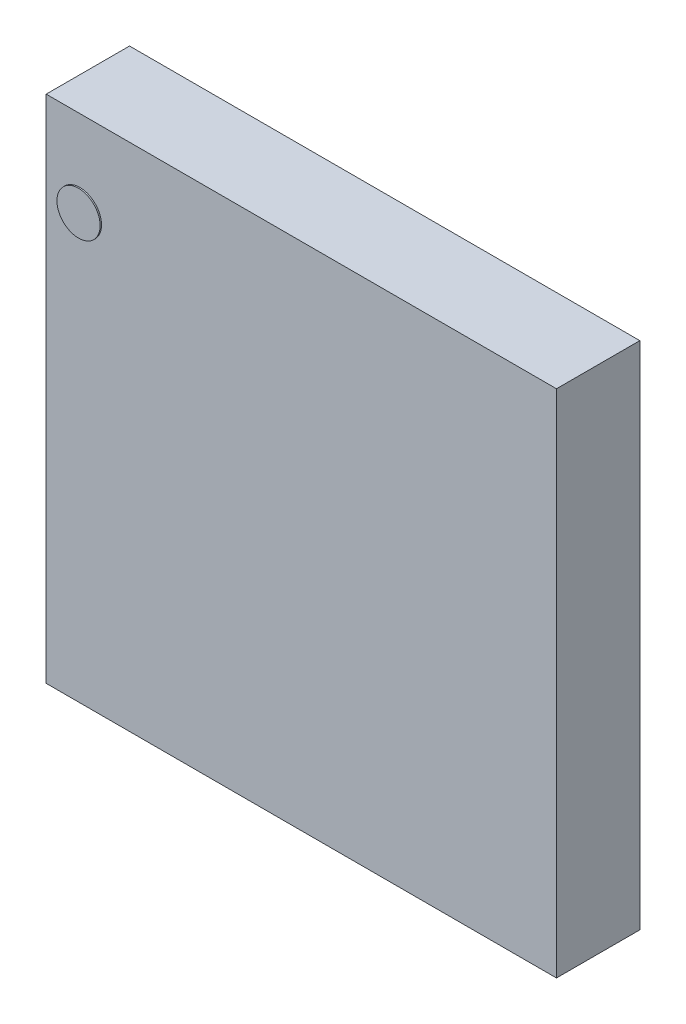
ISO-10303-21;
HEADER;
FILE_DESCRIPTION(('STEP AP214'),'2;1');
FILE_NAME('part.step','',(''),(''),'','','');
FILE_SCHEMA(('AUTOMOTIVE_DESIGN { 1 0 10303 214 1 1 1 1 }'));
ENDSEC;
DATA;
#1=APPLICATION_CONTEXT('core data for automotive mechanical design processes');
#2=APPLICATION_PROTOCOL_DEFINITION('international standard','automotive_design',2000,#1);
#3=PRODUCT_CONTEXT('',#1,'mechanical');
#4=PRODUCT('Part','Part','',(#3));
#5=PRODUCT_RELATED_PRODUCT_CATEGORY('part','',(#4));
#6=PRODUCT_DEFINITION_FORMATION('','',#4);
#7=PRODUCT_DEFINITION_CONTEXT('part definition',#1,'design');
#8=PRODUCT_DEFINITION('design','',#6,#7);
#9=PRODUCT_DEFINITION_SHAPE('','',#8);
#10=(LENGTH_UNIT() NAMED_UNIT(*) SI_UNIT(.MILLI.,.METRE.));
#11=(NAMED_UNIT(*) PLANE_ANGLE_UNIT() SI_UNIT($,.RADIAN.));
#12=(NAMED_UNIT(*) SI_UNIT($,.STERADIAN.) SOLID_ANGLE_UNIT());
#13=UNCERTAINTY_MEASURE_WITH_UNIT(LENGTH_MEASURE(1.E-05),#10,'distance_accuracy_value','');
#14=(GEOMETRIC_REPRESENTATION_CONTEXT(3) GLOBAL_UNCERTAINTY_ASSIGNED_CONTEXT((#13)) GLOBAL_UNIT_ASSIGNED_CONTEXT((#10,
#11,#12)) REPRESENTATION_CONTEXT('',''));
#15=CARTESIAN_POINT('',(0.,0.,0.));
#16=DIRECTION('',(0.,0.,1.));
#17=DIRECTION('',(1.,0.,0.));
#18=AXIS2_PLACEMENT_3D('',#15,#16,#17);
#19=CARTESIAN_POINT('',(-2.60345935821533,1.99397361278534,0.0253999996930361));
#20=DIRECTION('',(0.,0.,-1.));
#21=DIRECTION('',(0.999999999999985,1.74845553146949E-07,0.));
#22=AXIS2_PLACEMENT_3D('',#19,#20,#21);
#23=CYLINDRICAL_SURFACE('',#22,0.254);
#24=CARTESIAN_POINT('',(-2.60345935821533,1.99397361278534,0.0253999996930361));
#25=DIRECTION('',(0.,0.,1.));
#26=DIRECTION('',(0.999999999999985,1.74845553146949E-07,0.));
#27=AXIS2_PLACEMENT_3D('',#24,#25,#26);
#28=CIRCLE('',#27,0.254);
#29=CARTESIAN_POINT('',(-2.34945935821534,1.99397365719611,0.0253999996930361));
#30=VERTEX_POINT('',#29);
#31=EDGE_CURVE('P0_E11',#30,#30,#28,.T.);
#32=ORIENTED_EDGE('',*,*,#31,.T.);
#33=DIRECTION('',(0.,0.,1.));
#34=VECTOR('',#33,1.);
#35=CARTESIAN_POINT('',(-2.34945935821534,1.99397365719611,0.0253999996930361));
#36=LINE('',#35,#34);
#37=CARTESIAN_POINT('',(-2.34945935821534,1.99397365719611,1.01599999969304));
#38=VERTEX_POINT('',#37);
#39=EDGE_CURVE('P0_E24',#30,#38,#36,.T.);
#40=ORIENTED_EDGE('',*,*,#39,.T.);
#41=CARTESIAN_POINT('',(-2.60345935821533,1.99397361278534,1.01599999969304));
#42=DIRECTION('',(0.,0.,1.));
#43=DIRECTION('',(0.999999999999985,1.74845553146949E-07,0.));
#44=AXIS2_PLACEMENT_3D('',#41,#42,#43);
#45=CIRCLE('',#44,0.254);
#46=EDGE_CURVE('P0_E32',#38,#38,#45,.T.);
#47=ORIENTED_EDGE('',*,*,#46,.F.);
#48=ORIENTED_EDGE('',*,*,#39,.F.);
#49=EDGE_LOOP('',(#32,#40,#47,#48));
#50=FACE_BOUND('',#49,.T.);
#51=ADVANCED_FACE('P0_F17',(#50),#23,.T.);
#52=CARTESIAN_POINT('',(-2.34945935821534,1.99397365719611,0.0253999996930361));
#53=DIRECTION('',(0.,0.,-1.));
#54=DIRECTION('',(-0.999999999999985,-1.74845553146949E-07,0.));
#55=AXIS2_PLACEMENT_3D('',#52,#53,#54);
#56=PLANE('',#55);
#57=ORIENTED_EDGE('',*,*,#31,.F.);
#58=EDGE_LOOP('',(#57));
#59=FACE_BOUND('',#58,.T.);
#60=ADVANCED_FACE('P0_F37',(#59),#56,.T.);
#61=CARTESIAN_POINT('',(-2.34945935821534,1.99397365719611,1.01599999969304));
#62=DIRECTION('',(0.,0.,-1.));
#63=DIRECTION('',(-0.999999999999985,-1.74845553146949E-07,0.));
#64=AXIS2_PLACEMENT_3D('',#61,#62,#63);
#65=PLANE('',#64);
#66=ORIENTED_EDGE('',*,*,#46,.T.);
#67=EDGE_LOOP('',(#66));
#68=FACE_BOUND('',#67,.T.);
#69=ADVANCED_FACE('P0_F34',(#68),#65,.F.);
#70=CLOSED_SHELL('',(#51,#60,#69));
#71=MANIFOLD_SOLID_BREP('P0_B1',#70);
#72=CARTESIAN_POINT('',(-2.99999934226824,2.99999881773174,0.019999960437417));
#73=DIRECTION('',(-8.74227765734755E-08,0.999999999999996,0.));
#74=DIRECTION('',(0.999999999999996,8.74227765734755E-08,0.));
#75=AXIS2_PLACEMENT_3D('',#72,#73,#74);
#76=PLANE('',#75);
#77=DIRECTION('',(0.,0.,1.));
#78=VECTOR('',#77,1.);
#79=CARTESIAN_POINT('',(-2.99999934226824,2.99999881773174,0.019999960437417));
#80=LINE('',#79,#78);
#81=CARTESIAN_POINT('',(-2.99999934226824,2.99999881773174,0.019999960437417));
#82=VERTEX_POINT('',#81);
#83=CARTESIAN_POINT('',(-2.99999934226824,2.99999881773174,1.00000054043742));
#84=VERTEX_POINT('',#83);
#85=EDGE_CURVE('P1_E11',#82,#84,#80,.T.);
#86=ORIENTED_EDGE('',*,*,#85,.T.);
#87=DIRECTION('',(0.999999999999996,8.74227765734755E-08,0.));
#88=VECTOR('',#87,1.);
#89=CARTESIAN_POINT('',(-2.99999934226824,2.99999881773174,1.00000054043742));
#90=LINE('',#89,#88);
#91=CARTESIAN_POINT('',(2.99999881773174,2.99999934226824,1.00000054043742));
#92=VERTEX_POINT('',#91);
#93=EDGE_CURVE('P1_E24',#84,#92,#90,.T.);
#94=ORIENTED_EDGE('',*,*,#93,.T.);
#95=DIRECTION('',(0.,0.,1.));
#96=VECTOR('',#95,1.);
#97=CARTESIAN_POINT('',(2.99999881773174,2.99999934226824,0.019999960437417));
#98=LINE('',#97,#96);
#99=CARTESIAN_POINT('',(2.99999881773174,2.99999934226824,0.019999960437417));
#100=VERTEX_POINT('',#99);
#101=EDGE_CURVE('P1_E84',#100,#92,#98,.T.);
#102=ORIENTED_EDGE('',*,*,#101,.F.);
#103=DIRECTION('',(0.999999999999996,8.74227765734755E-08,0.));
#104=VECTOR('',#103,1.);
#105=CARTESIAN_POINT('',(-2.99999934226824,2.99999881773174,0.019999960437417));
#106=LINE('',#105,#104);
#107=EDGE_CURVE('P1_E82',#82,#100,#106,.T.);
#108=ORIENTED_EDGE('',*,*,#107,.F.);
#109=EDGE_LOOP('',(#86,#94,#102,#108));
#110=FACE_BOUND('',#109,.T.);
#111=ADVANCED_FACE('P1_F17',(#110),#76,.T.);
#112=CARTESIAN_POINT('',(2.99999881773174,2.99999934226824,0.019999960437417));
#113=DIRECTION('',(0.999999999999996,8.74227765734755E-08,0.));
#114=DIRECTION('',(8.74227765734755E-08,-0.999999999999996,0.));
#115=AXIS2_PLACEMENT_3D('',#112,#113,#114);
#116=PLANE('',#115);
#117=ORIENTED_EDGE('',*,*,#101,.T.);
#118=DIRECTION('',(8.74227765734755E-08,-0.999999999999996,0.));
#119=VECTOR('',#118,1.);
#120=CARTESIAN_POINT('',(2.99999881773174,2.99999934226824,1.00000054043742));
#121=LINE('',#120,#119);
#122=CARTESIAN_POINT('',(2.99999934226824,-2.99999881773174,1.00000054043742));
#123=VERTEX_POINT('',#122);
#124=EDGE_CURVE('P1_E79',#92,#123,#121,.T.);
#125=ORIENTED_EDGE('',*,*,#124,.T.);
#126=DIRECTION('',(0.,0.,1.));
#127=VECTOR('',#126,1.);
#128=CARTESIAN_POINT('',(2.99999934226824,-2.99999881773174,0.019999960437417));
#129=LINE('',#128,#127);
#130=CARTESIAN_POINT('',(2.99999934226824,-2.99999881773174,0.019999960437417));
#131=VERTEX_POINT('',#130);
#132=EDGE_CURVE('P1_E77',#131,#123,#129,.T.);
#133=ORIENTED_EDGE('',*,*,#132,.F.);
#134=DIRECTION('',(8.74227765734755E-08,-0.999999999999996,0.));
#135=VECTOR('',#134,1.);
#136=CARTESIAN_POINT('',(2.99999881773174,2.99999934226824,0.019999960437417));
#137=LINE('',#136,#135);
#138=EDGE_CURVE('P1_E59',#100,#131,#137,.T.);
#139=ORIENTED_EDGE('',*,*,#138,.F.);
#140=EDGE_LOOP('',(#117,#125,#133,#139));
#141=FACE_BOUND('',#140,.T.);
#142=ADVANCED_FACE('P1_F90',(#141),#116,.T.);
#143=CARTESIAN_POINT('',(2.99999934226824,-2.99999881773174,0.019999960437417));
#144=DIRECTION('',(8.74227765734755E-08,-0.999999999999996,0.));
#145=DIRECTION('',(-0.999999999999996,-8.74227765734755E-08,0.));
#146=AXIS2_PLACEMENT_3D('',#143,#144,#145);
#147=PLANE('',#146);
#148=ORIENTED_EDGE('',*,*,#132,.T.);
#149=DIRECTION('',(-0.999999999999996,-8.74227765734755E-08,0.));
#150=VECTOR('',#149,1.);
#151=CARTESIAN_POINT('',(2.99999934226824,-2.99999881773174,1.00000054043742));
#152=LINE('',#151,#150);
#153=CARTESIAN_POINT('',(-2.99999881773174,-2.99999934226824,1.00000054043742));
#154=VERTEX_POINT('',#153);
#155=EDGE_CURVE('P1_E68',#123,#154,#152,.T.);
#156=ORIENTED_EDGE('',*,*,#155,.T.);
#157=DIRECTION('',(0.,0.,1.));
#158=VECTOR('',#157,1.);
#159=CARTESIAN_POINT('',(-2.99999881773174,-2.99999934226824,0.019999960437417));
#160=LINE('',#159,#158);
#161=CARTESIAN_POINT('',(-2.99999881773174,-2.99999934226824,0.019999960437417));
#162=VERTEX_POINT('',#161);
#163=EDGE_CURVE('P1_E63',#162,#154,#160,.T.);
#164=ORIENTED_EDGE('',*,*,#163,.F.);
#165=DIRECTION('',(-0.999999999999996,-8.74227765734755E-08,0.));
#166=VECTOR('',#165,1.);
#167=CARTESIAN_POINT('',(2.99999934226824,-2.99999881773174,0.019999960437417));
#168=LINE('',#167,#166);
#169=EDGE_CURVE('P1_E54',#131,#162,#168,.T.);
#170=ORIENTED_EDGE('',*,*,#169,.F.);
#171=EDGE_LOOP('',(#148,#156,#164,#170));
#172=FACE_BOUND('',#171,.T.);
#173=ADVANCED_FACE('P1_F67',(#172),#147,.T.);
#174=CARTESIAN_POINT('',(-2.99999881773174,-2.99999934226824,0.019999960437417));
#175=DIRECTION('',(-0.999999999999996,-8.74227765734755E-08,0.));
#176=DIRECTION('',(-8.74227765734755E-08,0.999999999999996,0.));
#177=AXIS2_PLACEMENT_3D('',#174,#175,#176);
#178=PLANE('',#177);
#179=ORIENTED_EDGE('',*,*,#163,.T.);
#180=DIRECTION('',(-8.74227765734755E-08,0.999999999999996,0.));
#181=VECTOR('',#180,1.);
#182=CARTESIAN_POINT('',(-2.99999881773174,-2.99999934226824,1.00000054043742));
#183=LINE('',#182,#181);
#184=EDGE_CURVE('P1_E64',#154,#84,#183,.T.);
#185=ORIENTED_EDGE('',*,*,#184,.T.);
#186=ORIENTED_EDGE('',*,*,#85,.F.);
#187=DIRECTION('',(-8.74227765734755E-08,0.999999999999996,0.));
#188=VECTOR('',#187,1.);
#189=CARTESIAN_POINT('',(-2.99999881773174,-2.99999934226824,0.019999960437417));
#190=LINE('',#189,#188);
#191=EDGE_CURVE('P1_E58',#162,#82,#190,.T.);
#192=ORIENTED_EDGE('',*,*,#191,.F.);
#193=EDGE_LOOP('',(#179,#185,#186,#192));
#194=FACE_BOUND('',#193,.T.);
#195=ADVANCED_FACE('P1_F71',(#194),#178,.T.);
#196=CARTESIAN_POINT('',(-2.99999934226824,2.99999881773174,0.019999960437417));
#197=DIRECTION('',(0.,0.,1.));
#198=DIRECTION('',(-0.999999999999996,-8.74227765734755E-08,0.));
#199=AXIS2_PLACEMENT_3D('',#196,#197,#198);
#200=PLANE('',#199);
#201=ORIENTED_EDGE('',*,*,#107,.T.);
#202=ORIENTED_EDGE('',*,*,#138,.T.);
#203=ORIENTED_EDGE('',*,*,#169,.T.);
#204=ORIENTED_EDGE('',*,*,#191,.T.);
#205=EDGE_LOOP('',(#201,#202,#203,#204));
#206=FACE_BOUND('',#205,.T.);
#207=ADVANCED_FACE('P1_F57',(#206),#200,.F.);
#208=CARTESIAN_POINT('',(-2.99999934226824,2.99999881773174,1.00000054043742));
#209=DIRECTION('',(0.,0.,1.));
#210=DIRECTION('',(-0.999999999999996,-8.74227765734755E-08,0.));
#211=AXIS2_PLACEMENT_3D('',#208,#209,#210);
#212=PLANE('',#211);
#213=ORIENTED_EDGE('',*,*,#184,.F.);
#214=ORIENTED_EDGE('',*,*,#155,.F.);
#215=ORIENTED_EDGE('',*,*,#124,.F.);
#216=ORIENTED_EDGE('',*,*,#93,.F.);
#217=EDGE_LOOP('',(#213,#214,#215,#216));
#218=FACE_BOUND('',#217,.T.);
#219=ADVANCED_FACE('P1_F91',(#218),#212,.T.);
#220=CLOSED_SHELL('',(#111,#142,#173,#195,#207,#219));
#221=MANIFOLD_SOLID_BREP('P1_B1',#220);
#222=ADVANCED_BREP_SHAPE_REPRESENTATION('',(#18,#71,#221),#14);
#223=SHAPE_DEFINITION_REPRESENTATION(#9,#222);
ENDSEC;
END-ISO-10303-21;
